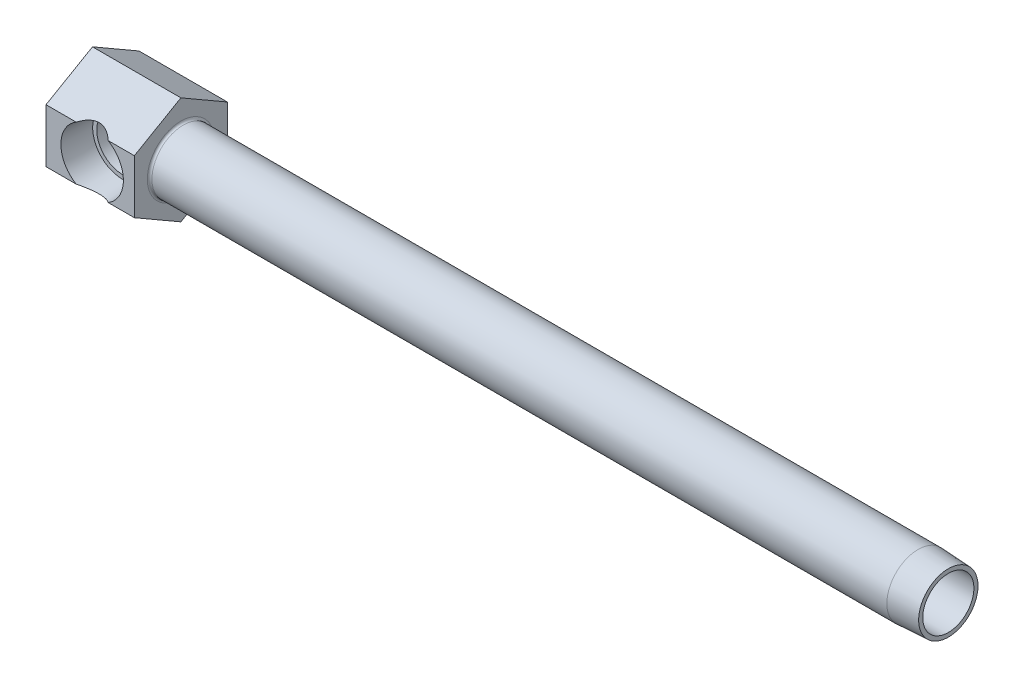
ISO-10303-21;
HEADER;
FILE_DESCRIPTION(('STEP AP214'),'2;1');
FILE_NAME('part.step','',(''),(''),'','','');
FILE_SCHEMA(('AUTOMOTIVE_DESIGN { 1 0 10303 214 1 1 1 1 }'));
ENDSEC;
DATA;
#1=APPLICATION_CONTEXT('core data for automotive mechanical design processes');
#2=APPLICATION_PROTOCOL_DEFINITION('international standard','automotive_design',2000,#1);
#3=PRODUCT_CONTEXT('',#1,'mechanical');
#4=PRODUCT('Part','Part','',(#3));
#5=PRODUCT_RELATED_PRODUCT_CATEGORY('part','',(#4));
#6=PRODUCT_DEFINITION_FORMATION('','',#4);
#7=PRODUCT_DEFINITION_CONTEXT('part definition',#1,'design');
#8=PRODUCT_DEFINITION('design','',#6,#7);
#9=PRODUCT_DEFINITION_SHAPE('','',#8);
#10=(LENGTH_UNIT() NAMED_UNIT(*) SI_UNIT(.MILLI.,.METRE.));
#11=(NAMED_UNIT(*) PLANE_ANGLE_UNIT() SI_UNIT($,.RADIAN.));
#12=(NAMED_UNIT(*) SI_UNIT($,.STERADIAN.) SOLID_ANGLE_UNIT());
#13=UNCERTAINTY_MEASURE_WITH_UNIT(LENGTH_MEASURE(1.E-05),#10,'distance_accuracy_value','');
#14=(GEOMETRIC_REPRESENTATION_CONTEXT(3) GLOBAL_UNCERTAINTY_ASSIGNED_CONTEXT((#13)) GLOBAL_UNIT_ASSIGNED_CONTEXT((#10,
#11,#12)) REPRESENTATION_CONTEXT('',''));
#15=CARTESIAN_POINT('',(0.,0.,0.));
#16=DIRECTION('',(0.,0.,1.));
#17=DIRECTION('',(1.,0.,0.));
#18=AXIS2_PLACEMENT_3D('',#15,#16,#17);
#19=CARTESIAN_POINT('',(63.5,0.,15.875));
#20=DIRECTION('',(-1.,0.,0.));
#21=DIRECTION('',(0.,0.,1.));
#22=AXIS2_PLACEMENT_3D('',#19,#20,#21);
#23=CYLINDRICAL_SURFACE('',#22,10.668);
#24=CARTESIAN_POINT('',(30.9499,0.,15.875));
#25=DIRECTION('',(1.,0.,0.));
#26=DIRECTION('',(0.,1.,0.));
#27=AXIS2_PLACEMENT_3D('',#24,#25,#26);
#28=CIRCLE('',#27,10.668);
#29=CARTESIAN_POINT('',(30.9499,10.668,15.875));
#30=VERTEX_POINT('',#29);
#31=EDGE_CURVE('E191',#30,#30,#28,.T.);
#32=ORIENTED_EDGE('',*,*,#31,.T.);
#33=EDGE_LOOP('',(#32));
#34=FACE_BOUND('',#33,.T.);
#35=CARTESIAN_POINT('',(281.7876,0.,15.875));
#36=DIRECTION('',(1.,0.,0.));
#37=DIRECTION('',(0.,0.,-1.));
#38=AXIS2_PLACEMENT_3D('',#35,#36,#37);
#39=CIRCLE('',#38,10.668);
#40=CARTESIAN_POINT('',(281.7876,0.,5.207));
#41=VERTEX_POINT('',#40);
#42=EDGE_CURVE('E256',#41,#41,#39,.T.);
#43=ORIENTED_EDGE('',*,*,#42,.F.);
#44=EDGE_LOOP('',(#43));
#45=FACE_BOUND('',#44,.T.);
#46=ADVANCED_FACE('F15',(#34,#45),#23,.T.);
#47=CARTESIAN_POINT('',(30.1625,18.3308710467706,15.875));
#48=DIRECTION('',(0.,-0.866025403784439,-0.5));
#49=DIRECTION('',(0.,0.5,-0.866025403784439));
#50=AXIS2_PLACEMENT_3D('',#47,#48,#49);
#51=PLANE('',#50);
#52=CARTESIAN_POINT('',(15.748,-1.05255916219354,49.4480859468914));
#53=DIRECTION('',(0.,-0.866025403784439,-0.5));
#54=DIRECTION('',(0.,-0.5,0.866025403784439));
#55=AXIS2_PLACEMENT_3D('',#52,#53,#54);
#56=ELLIPSE('',#55,23.191034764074,11.5476466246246);
#57=CARTESIAN_POINT('',(21.2070306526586,9.16543552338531,31.75));
#58=VERTEX_POINT('',#57);
#59=CARTESIAN_POINT('',(10.2889693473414,9.16543552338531,31.75));
#60=VERTEX_POINT('',#59);
#61=EDGE_CURVE('E135',#58,#60,#56,.F.);
#62=ORIENTED_EDGE('',*,*,#61,.F.);
#63=DIRECTION('',(-1.,0.,0.));
#64=VECTOR('',#63,1.);
#65=CARTESIAN_POINT('',(30.1625,9.16543552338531,31.75));
#66=LINE('',#65,#64);
#67=CARTESIAN_POINT('',(30.1625,9.16543552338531,31.75));
#68=VERTEX_POINT('',#67);
#69=EDGE_CURVE('E179',#68,#58,#66,.T.);
#70=ORIENTED_EDGE('',*,*,#69,.F.);
#71=DIRECTION('',(0.,-0.5,0.866025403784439));
#72=VECTOR('',#71,1.);
#73=CARTESIAN_POINT('',(30.1625,18.3308710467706,15.875));
#74=LINE('',#73,#72);
#75=CARTESIAN_POINT('',(30.1625,18.3308710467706,15.875));
#76=VERTEX_POINT('',#75);
#77=EDGE_CURVE('E163',#76,#68,#74,.T.);
#78=ORIENTED_EDGE('',*,*,#77,.F.);
#79=DIRECTION('',(-1.,0.,0.));
#80=VECTOR('',#79,1.);
#81=CARTESIAN_POINT('',(30.1625,18.3308710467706,15.875));
#82=LINE('',#81,#80);
#83=CARTESIAN_POINT('',(0.,18.3308710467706,15.875));
#84=VERTEX_POINT('',#83);
#85=EDGE_CURVE('E182',#76,#84,#82,.T.);
#86=ORIENTED_EDGE('',*,*,#85,.T.);
#87=DIRECTION('',(0.,-0.5,0.866025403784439));
#88=VECTOR('',#87,1.);
#89=CARTESIAN_POINT('',(0.,18.3308710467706,15.875));
#90=LINE('',#89,#88);
#91=CARTESIAN_POINT('',(0.,9.16543552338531,31.75));
#92=VERTEX_POINT('',#91);
#93=EDGE_CURVE('E144',#84,#92,#90,.T.);
#94=ORIENTED_EDGE('',*,*,#93,.T.);
#95=EDGE_CURVE('E178',#60,#92,#66,.T.);
#96=ORIENTED_EDGE('',*,*,#95,.F.);
#97=EDGE_LOOP('',(#62,#70,#78,#86,#94,#96));
#98=FACE_BOUND('',#97,.T.);
#99=ADVANCED_FACE('F210',(#98),#51,.F.);
#100=CARTESIAN_POINT('',(30.1625,9.16543552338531,31.75));
#101=DIRECTION('',(0.,0.,-1.));
#102=DIRECTION('',(-1.,0.,0.));
#103=AXIS2_PLACEMENT_3D('',#100,#101,#102);
#104=PLANE('',#103);
#105=CARTESIAN_POINT('',(15.748,0.,31.75));
#106=DIRECTION('',(0.,0.,-1.));
#107=DIRECTION('',(-1.,0.,0.));
#108=AXIS2_PLACEMENT_3D('',#105,#106,#107);
#109=CIRCLE('',#108,10.668);
#110=CARTESIAN_POINT('',(21.2070306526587,-9.1654355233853,31.75));
#111=VERTEX_POINT('',#110);
#112=EDGE_CURVE('E133',#58,#111,#109,.T.);
#113=ORIENTED_EDGE('',*,*,#112,.T.);
#114=DIRECTION('',(-1.,0.,0.));
#115=VECTOR('',#114,1.);
#116=CARTESIAN_POINT('',(30.1625,-9.1654355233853,31.75));
#117=LINE('',#116,#115);
#118=CARTESIAN_POINT('',(30.1625,-9.1654355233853,31.75));
#119=VERTEX_POINT('',#118);
#120=EDGE_CURVE('E175',#119,#111,#117,.T.);
#121=ORIENTED_EDGE('',*,*,#120,.F.);
#122=DIRECTION('',(0.,-1.,0.));
#123=VECTOR('',#122,1.);
#124=CARTESIAN_POINT('',(30.1625,9.16543552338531,31.75));
#125=LINE('',#124,#123);
#126=EDGE_CURVE('E165',#68,#119,#125,.T.);
#127=ORIENTED_EDGE('',*,*,#126,.F.);
#128=ORIENTED_EDGE('',*,*,#69,.T.);
#129=EDGE_LOOP('',(#113,#121,#127,#128));
#130=FACE_BOUND('',#129,.T.);
#131=ADVANCED_FACE('F206',(#130),#104,.F.);
#132=CARTESIAN_POINT('',(10.2889693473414,-9.1654355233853,31.75));
#133=VERTEX_POINT('',#132);
#134=EDGE_CURVE('E40',#133,#60,#109,.T.);
#135=ORIENTED_EDGE('',*,*,#134,.T.);
#136=ORIENTED_EDGE('',*,*,#95,.T.);
#137=DIRECTION('',(0.,-1.,0.));
#138=VECTOR('',#137,1.);
#139=CARTESIAN_POINT('',(0.,9.16543552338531,31.75));
#140=LINE('',#139,#138);
#141=CARTESIAN_POINT('',(0.,-9.1654355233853,31.75));
#142=VERTEX_POINT('',#141);
#143=EDGE_CURVE('E148',#92,#142,#140,.T.);
#144=ORIENTED_EDGE('',*,*,#143,.T.);
#145=EDGE_CURVE('E174',#133,#142,#117,.T.);
#146=ORIENTED_EDGE('',*,*,#145,.F.);
#147=EDGE_LOOP('',(#135,#136,#144,#146));
#148=FACE_BOUND('',#147,.T.);
#149=ADVANCED_FACE('F213',(#148),#104,.F.);
#150=CARTESIAN_POINT('',(30.1625,-9.1654355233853,31.75));
#151=DIRECTION('',(0.,0.866025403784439,-0.5));
#152=DIRECTION('',(0.,0.5,0.866025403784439));
#153=AXIS2_PLACEMENT_3D('',#150,#151,#152);
#154=PLANE('',#153);
#155=CARTESIAN_POINT('',(15.748,1.05255916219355,49.4480859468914));
#156=DIRECTION('',(0.,0.866025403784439,-0.5));
#157=DIRECTION('',(0.,0.5,0.866025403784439));
#158=AXIS2_PLACEMENT_3D('',#155,#156,#157);
#159=ELLIPSE('',#158,23.191034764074,11.5476466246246);
#160=EDGE_CURVE('E26',#133,#111,#159,.F.);
#161=ORIENTED_EDGE('',*,*,#160,.F.);
#162=ORIENTED_EDGE('',*,*,#145,.T.);
#163=DIRECTION('',(0.,-0.5,-0.866025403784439));
#164=VECTOR('',#163,1.);
#165=CARTESIAN_POINT('',(0.,-9.1654355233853,31.75));
#166=LINE('',#165,#164);
#167=CARTESIAN_POINT('',(0.,-18.3308710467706,15.875));
#168=VERTEX_POINT('',#167);
#169=EDGE_CURVE('E152',#142,#168,#166,.T.);
#170=ORIENTED_EDGE('',*,*,#169,.T.);
#171=DIRECTION('',(-1.,0.,0.));
#172=VECTOR('',#171,1.);
#173=CARTESIAN_POINT('',(30.1625,-18.3308710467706,15.875));
#174=LINE('',#173,#172);
#175=CARTESIAN_POINT('',(30.1625,-18.3308710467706,15.875));
#176=VERTEX_POINT('',#175);
#177=EDGE_CURVE('E169',#176,#168,#174,.T.);
#178=ORIENTED_EDGE('',*,*,#177,.F.);
#179=DIRECTION('',(0.,-0.5,-0.866025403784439));
#180=VECTOR('',#179,1.);
#181=CARTESIAN_POINT('',(30.1625,-9.1654355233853,31.75));
#182=LINE('',#181,#180);
#183=EDGE_CURVE('E167',#119,#176,#182,.T.);
#184=ORIENTED_EDGE('',*,*,#183,.F.);
#185=ORIENTED_EDGE('',*,*,#120,.T.);
#186=EDGE_LOOP('',(#161,#162,#170,#178,#184,#185));
#187=FACE_BOUND('',#186,.T.);
#188=ADVANCED_FACE('F202',(#187),#154,.F.);
#189=CARTESIAN_POINT('',(30.1625,-18.3308710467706,15.875));
#190=DIRECTION('',(0.,0.866025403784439,0.5));
#191=DIRECTION('',(0.,-0.5,0.866025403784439));
#192=AXIS2_PLACEMENT_3D('',#189,#190,#191);
#193=PLANE('',#192);
#194=DIRECTION('',(0.,0.5,-0.866025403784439));
#195=VECTOR('',#194,1.);
#196=CARTESIAN_POINT('',(0.,-18.3308710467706,15.875));
#197=LINE('',#196,#195);
#198=CARTESIAN_POINT('',(0.,-9.16543552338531,0.));
#199=VERTEX_POINT('',#198);
#200=EDGE_CURVE('E137',#168,#199,#197,.T.);
#201=ORIENTED_EDGE('',*,*,#200,.T.);
#202=DIRECTION('',(-1.,0.,0.));
#203=VECTOR('',#202,1.);
#204=CARTESIAN_POINT('',(30.1625,-9.16543552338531,0.));
#205=LINE('',#204,#203);
#206=CARTESIAN_POINT('',(30.1625,-9.16543552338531,0.));
#207=VERTEX_POINT('',#206);
#208=EDGE_CURVE('E188',#207,#199,#205,.T.);
#209=ORIENTED_EDGE('',*,*,#208,.F.);
#210=DIRECTION('',(0.,0.5,-0.866025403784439));
#211=VECTOR('',#210,1.);
#212=CARTESIAN_POINT('',(30.1625,-18.3308710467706,15.875));
#213=LINE('',#212,#211);
#214=EDGE_CURVE('E155',#176,#207,#213,.T.);
#215=ORIENTED_EDGE('',*,*,#214,.F.);
#216=ORIENTED_EDGE('',*,*,#177,.T.);
#217=EDGE_LOOP('',(#201,#209,#215,#216));
#218=FACE_BOUND('',#217,.T.);
#219=ADVANCED_FACE('F220',(#218),#193,.F.);
#220=CARTESIAN_POINT('',(30.1625,-9.16543552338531,0.));
#221=DIRECTION('',(0.,0.,1.));
#222=DIRECTION('',(0.,-1.,0.));
#223=AXIS2_PLACEMENT_3D('',#220,#221,#222);
#224=PLANE('',#223);
#225=DIRECTION('',(0.,1.,0.));
#226=VECTOR('',#225,1.);
#227=CARTESIAN_POINT('',(0.,-9.16543552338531,0.));
#228=LINE('',#227,#226);
#229=CARTESIAN_POINT('',(0.,9.16543552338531,0.));
#230=VERTEX_POINT('',#229);
#231=EDGE_CURVE('E138',#199,#230,#228,.T.);
#232=ORIENTED_EDGE('',*,*,#231,.T.);
#233=DIRECTION('',(-1.,0.,0.));
#234=VECTOR('',#233,1.);
#235=CARTESIAN_POINT('',(30.1625,9.16543552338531,0.));
#236=LINE('',#235,#234);
#237=CARTESIAN_POINT('',(30.1625,9.16543552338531,0.));
#238=VERTEX_POINT('',#237);
#239=EDGE_CURVE('E185',#238,#230,#236,.T.);
#240=ORIENTED_EDGE('',*,*,#239,.F.);
#241=DIRECTION('',(0.,1.,0.));
#242=VECTOR('',#241,1.);
#243=CARTESIAN_POINT('',(30.1625,-9.16543552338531,0.));
#244=LINE('',#243,#242);
#245=EDGE_CURVE('E159',#207,#238,#244,.T.);
#246=ORIENTED_EDGE('',*,*,#245,.F.);
#247=ORIENTED_EDGE('',*,*,#208,.T.);
#248=EDGE_LOOP('',(#232,#240,#246,#247));
#249=FACE_BOUND('',#248,.T.);
#250=ADVANCED_FACE('F227',(#249),#224,.F.);
#251=CARTESIAN_POINT('',(30.1625,9.16543552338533,0.));
#252=DIRECTION('',(0.,-0.86602540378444,0.5));
#253=DIRECTION('',(0.,-0.5,-0.86602540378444));
#254=AXIS2_PLACEMENT_3D('',#251,#252,#253);
#255=PLANE('',#254);
#256=DIRECTION('',(0.,0.5,0.86602540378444));
#257=VECTOR('',#256,1.);
#258=CARTESIAN_POINT('',(0.,9.16543552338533,0.));
#259=LINE('',#258,#257);
#260=EDGE_CURVE('E141',#230,#84,#259,.T.);
#261=ORIENTED_EDGE('',*,*,#260,.T.);
#262=ORIENTED_EDGE('',*,*,#85,.F.);
#263=DIRECTION('',(0.,0.5,0.86602540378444));
#264=VECTOR('',#263,1.);
#265=CARTESIAN_POINT('',(30.1625,9.16543552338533,0.));
#266=LINE('',#265,#264);
#267=EDGE_CURVE('E161',#238,#76,#266,.T.);
#268=ORIENTED_EDGE('',*,*,#267,.F.);
#269=ORIENTED_EDGE('',*,*,#239,.T.);
#270=EDGE_LOOP('',(#261,#262,#268,#269));
#271=FACE_BOUND('',#270,.T.);
#272=ADVANCED_FACE('F233',(#271),#255,.F.);
#273=CARTESIAN_POINT('',(30.1625,-9.16543552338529,0.));
#274=DIRECTION('',(1.,0.,0.));
#275=DIRECTION('',(0.,1.,0.));
#276=AXIS2_PLACEMENT_3D('',#273,#274,#275);
#277=PLANE('',#276);
#278=CARTESIAN_POINT('',(30.1625,0.,15.875));
#279=DIRECTION('',(1.,0.,0.));
#280=DIRECTION('',(0.,1.,0.));
#281=AXIS2_PLACEMENT_3D('',#278,#279,#280);
#282=CIRCLE('',#281,11.4554);
#283=CARTESIAN_POINT('',(30.1625,11.4554,15.875));
#284=VERTEX_POINT('',#283);
#285=EDGE_CURVE('E194',#284,#284,#282,.F.);
#286=ORIENTED_EDGE('',*,*,#285,.T.);
#287=EDGE_LOOP('',(#286));
#288=FACE_BOUND('',#287,.T.);
#289=ORIENTED_EDGE('',*,*,#214,.T.);
#290=ORIENTED_EDGE('',*,*,#245,.T.);
#291=ORIENTED_EDGE('',*,*,#267,.T.);
#292=ORIENTED_EDGE('',*,*,#77,.T.);
#293=ORIENTED_EDGE('',*,*,#126,.T.);
#294=ORIENTED_EDGE('',*,*,#183,.T.);
#295=EDGE_LOOP('',(#289,#290,#291,#292,#293,#294));
#296=FACE_BOUND('',#295,.T.);
#297=ADVANCED_FACE('F230',(#288,#296),#277,.T.);
#298=CARTESIAN_POINT('',(0.,-9.16543552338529,0.));
#299=DIRECTION('',(1.,0.,0.));
#300=DIRECTION('',(0.,1.,0.));
#301=AXIS2_PLACEMENT_3D('',#298,#299,#300);
#302=PLANE('',#301);
#303=ORIENTED_EDGE('',*,*,#200,.F.);
#304=ORIENTED_EDGE('',*,*,#169,.F.);
#305=ORIENTED_EDGE('',*,*,#143,.F.);
#306=ORIENTED_EDGE('',*,*,#93,.F.);
#307=ORIENTED_EDGE('',*,*,#260,.F.);
#308=ORIENTED_EDGE('',*,*,#231,.F.);
#309=EDGE_LOOP('',(#303,#304,#305,#306,#307,#308));
#310=FACE_BOUND('',#309,.T.);
#311=ADVANCED_FACE('F222',(#310),#302,.F.);
#312=CARTESIAN_POINT('',(30.9499,0.,15.875));
#313=DIRECTION('',(1.,0.,0.));
#314=DIRECTION('',(0.,1.,0.));
#315=AXIS2_PLACEMENT_3D('',#312,#313,#314);
#316=TOROIDAL_SURFACE('',#315,11.4554,0.7874);
#317=ORIENTED_EDGE('',*,*,#285,.F.);
#318=EDGE_LOOP('',(#317));
#319=FACE_BOUND('',#318,.T.);
#320=ORIENTED_EDGE('',*,*,#31,.F.);
#321=EDGE_LOOP('',(#320));
#322=FACE_BOUND('',#321,.T.);
#323=ADVANCED_FACE('F331',(#319,#322),#316,.F.);
#324=CARTESIAN_POINT('',(15.748,0.,31.75));
#325=DIRECTION('',(0.,0.,1.));
#326=DIRECTION('',(1.,0.,0.));
#327=AXIS2_PLACEMENT_3D('',#324,#325,#326);
#328=CONICAL_SURFACE('',#327,10.668,0.0523598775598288);
#329=CARTESIAN_POINT('',(23.3158678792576,-6.73011387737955,21.4374));
#330=CARTESIAN_POINT('',(23.4600282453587,-6.58213571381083,21.6163914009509));
#331=CARTESIAN_POINT('',(23.6023884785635,-6.42627781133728,21.7904706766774));
#332=CARTESIAN_POINT('',(23.8817354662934,-6.09837401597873,22.1280133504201));
#333=CARTESIAN_POINT('',(24.0187135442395,-5.92630339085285,22.2914598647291));
#334=CARTESIAN_POINT('',(24.2862441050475,-5.56440643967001,22.6077795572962));
#335=CARTESIAN_POINT('',(24.4167288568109,-5.37443622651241,22.7605461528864));
#336=CARTESIAN_POINT('',(24.6677167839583,-4.97815123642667,23.0522714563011));
#337=CARTESIAN_POINT('',(24.7882261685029,-4.77184678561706,23.1912387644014));
#338=CARTESIAN_POINT('',(24.9921660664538,-4.38969848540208,23.4250980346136));
#339=CARTESIAN_POINT('',(25.0779672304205,-4.21696245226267,23.5230096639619));
#340=CARTESIAN_POINT('',(25.2408840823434,-3.86199712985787,23.7082473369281));
#341=CARTESIAN_POINT('',(25.3180018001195,-3.67977007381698,23.7955758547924));
#342=CARTESIAN_POINT('',(25.4621670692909,-3.30686520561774,23.9583559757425));
#343=CARTESIAN_POINT('',(25.529240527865,-3.11621083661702,24.0338381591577));
#344=CARTESIAN_POINT('',(25.6523303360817,-2.72696762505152,24.1720474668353));
#345=CARTESIAN_POINT('',(25.7083523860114,-2.52838293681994,24.2347811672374));
#346=CARTESIAN_POINT('',(25.808749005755,-2.12236093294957,24.3470188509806));
#347=CARTESIAN_POINT('',(25.8530023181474,-1.91485526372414,24.3963851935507));
#348=CARTESIAN_POINT('',(25.9281094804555,-1.49442789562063,24.4800766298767));
#349=CARTESIAN_POINT('',(25.9589631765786,-1.2815061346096,24.5144015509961));
#350=CARTESIAN_POINT('',(26.0065047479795,-0.852126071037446,24.5672608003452));
#351=CARTESIAN_POINT('',(26.023192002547,-0.635667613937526,24.5857944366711));
#352=CARTESIAN_POINT('',(26.0419565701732,-0.201352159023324,24.6066338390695));
#353=CARTESIAN_POINT('',(26.0440358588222,0.0165046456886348,24.6089417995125));
#354=CARTESIAN_POINT('',(26.0342583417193,0.421689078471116,24.5980844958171));
#355=CARTESIAN_POINT('',(26.0242658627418,0.609123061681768,24.5869892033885));
#356=CARTESIAN_POINT('',(25.9935596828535,0.982016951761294,24.552869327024));
#357=CARTESIAN_POINT('',(25.9728460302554,1.16747686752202,24.5298447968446));
#358=CARTESIAN_POINT('',(25.9211099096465,1.53498981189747,24.4722733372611));
#359=CARTESIAN_POINT('',(25.8900948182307,1.71704518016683,24.437734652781));
#360=CARTESIAN_POINT('',(25.8183100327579,2.07675633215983,24.3576745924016));
#361=CARTESIAN_POINT('',(25.7775399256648,2.25441192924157,24.3121527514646));
#362=CARTESIAN_POINT('',(25.6868155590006,2.6047674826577,24.2106610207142));
#363=CARTESIAN_POINT('',(25.6368406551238,2.77745527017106,24.1546676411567));
#364=CARTESIAN_POINT('',(25.5285266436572,3.11671661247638,24.0330221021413));
#365=CARTESIAN_POINT('',(25.4701845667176,3.28328797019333,23.9673665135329));
#366=CARTESIAN_POINT('',(25.2834921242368,3.77365322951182,23.7566792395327));
#367=CARTESIAN_POINT('',(25.1436492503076,4.08744436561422,23.5981203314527));
#368=CARTESIAN_POINT('',(24.8735653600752,4.61896069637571,23.289353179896));
#369=CARTESIAN_POINT('',(24.7480029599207,4.84261456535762,23.1450088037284));
#370=CARTESIAN_POINT('',(24.4850001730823,5.27158893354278,22.8402219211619));
#371=CARTESIAN_POINT('',(24.34754826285,5.47689124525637,22.6797637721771));
#372=CARTESIAN_POINT('',(24.0644488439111,5.86754844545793,22.3458754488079));
#373=CARTESIAN_POINT('',(23.918859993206,6.05302358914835,22.1725357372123));
#374=CARTESIAN_POINT('',(23.6957580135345,6.31733501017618,21.90341371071));
#375=CARTESIAN_POINT('',(23.6206767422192,6.40304815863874,21.8122772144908));
#376=CARTESIAN_POINT('',(23.4691939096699,6.56995442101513,21.6270388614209));
#377=CARTESIAN_POINT('',(23.3927925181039,6.65114811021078,21.5329373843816));
#378=CARTESIAN_POINT('',(23.3158678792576,6.73011387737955,21.4374));
#379=B_SPLINE_CURVE_WITH_KNOTS('',3,(#329,#330,#331,#332,#333,#334,#335,#336,#337,#338,#339,
#340,#341,#342,#343,#344,#345,#346,#347,#348,#349,#350,#351,#352,#353,#354,#355,#356,#357,#358,
#359,#360,#361,#362,#363,#364,#365,#366,#367,#368,#369,#370,#371,#372,#373,#374,#375,#376,#377,
#378),.UNSPECIFIED.,.F.,.F.,(4,2,2,2,2,2,2,2,2,2,2,2,2,2,2,2,2,2,2,2,2,2,2,2,4),(0.,
0.820023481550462,1.64131879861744,2.46989520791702,3.29795193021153,3.94627694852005,
4.59445010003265,5.24092150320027,5.8870585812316,6.53961554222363,7.19217999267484,
7.84477303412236,8.49727781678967,9.06067705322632,9.6240737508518,10.187067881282,
10.7500858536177,11.3143822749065,11.8788794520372,13.0099648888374,13.8917191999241,
14.7743379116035,15.65125682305,16.0888974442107,16.5264822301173),.UNSPECIFIED.);
#380=CARTESIAN_POINT('',(23.3160289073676,-6.72994857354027,21.4376));
#381=VERTEX_POINT('',#380);
#382=CARTESIAN_POINT('',(23.3160289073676,6.72994857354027,21.4376));
#383=VERTEX_POINT('',#382);
#384=EDGE_CURVE('E119',#381,#383,#379,.T.);
#385=ORIENTED_EDGE('',*,*,#384,.F.);
#386=CARTESIAN_POINT('',(15.748,0.,21.4376));
#387=DIRECTION('',(0.,0.,-1.));
#388=DIRECTION('',(-1.,0.,0.));
#389=AXIS2_PLACEMENT_3D('',#386,#387,#388);
#390=CIRCLE('',#389,10.1275500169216);
#391=EDGE_CURVE('E121',#381,#383,#390,.T.);
#392=ORIENTED_EDGE('',*,*,#391,.T.);
#393=EDGE_LOOP('',(#385,#392));
#394=FACE_BOUND('',#393,.T.);
#395=ORIENTED_EDGE('',*,*,#61,.T.);
#396=ORIENTED_EDGE('',*,*,#134,.F.);
#397=ORIENTED_EDGE('',*,*,#160,.T.);
#398=ORIENTED_EDGE('',*,*,#112,.F.);
#399=EDGE_LOOP('',(#395,#396,#397,#398));
#400=FACE_BOUND('',#399,.T.);
#401=ADVANCED_FACE('F196',(#394,#400),#328,.F.);
#402=CARTESIAN_POINT('',(25.8755500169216,0.,21.4376));
#403=DIRECTION('',(0.,0.,1.));
#404=DIRECTION('',(1.,0.,0.));
#405=AXIS2_PLACEMENT_3D('',#402,#403,#404);
#406=PLANE('',#405);
#407=DIRECTION('',(1.,0.,0.));
#408=VECTOR('',#407,1.);
#409=CARTESIAN_POINT('',(86.8155901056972,-6.72994857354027,21.4376));
#410=LINE('',#409,#408);
#411=CARTESIAN_POINT('',(21.3205618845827,-6.72994857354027,21.4376));
#412=VERTEX_POINT('',#411);
#413=EDGE_CURVE('E123',#412,#381,#410,.T.);
#414=ORIENTED_EDGE('',*,*,#413,.F.);
#415=CARTESIAN_POINT('',(15.748,0.,21.4376));
#416=DIRECTION('',(0.,0.,-1.));
#417=DIRECTION('',(-1.,0.,0.));
#418=AXIS2_PLACEMENT_3D('',#415,#416,#417);
#419=CIRCLE('',#418,8.7376);
#420=CARTESIAN_POINT('',(21.3205618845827,6.72994857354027,21.4376));
#421=VERTEX_POINT('',#420);
#422=EDGE_CURVE('E114',#412,#421,#419,.T.);
#423=ORIENTED_EDGE('',*,*,#422,.T.);
#424=DIRECTION('',(1.,0.,0.));
#425=VECTOR('',#424,1.);
#426=CARTESIAN_POINT('',(86.8155901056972,6.72994857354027,21.4376));
#427=LINE('',#426,#425);
#428=EDGE_CURVE('E115',#383,#421,#427,.F.);
#429=ORIENTED_EDGE('',*,*,#428,.F.);
#430=ORIENTED_EDGE('',*,*,#391,.F.);
#431=EDGE_LOOP('',(#414,#423,#429,#430));
#432=FACE_BOUND('',#431,.T.);
#433=ADVANCED_FACE('F316',(#432),#406,.T.);
#434=CARTESIAN_POINT('',(15.748,0.,43.0975954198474));
#435=DIRECTION('',(0.,0.,-1.));
#436=DIRECTION('',(-1.,0.,0.));
#437=AXIS2_PLACEMENT_3D('',#434,#435,#436);
#438=CYLINDRICAL_SURFACE('',#437,8.7376);
#439=CARTESIAN_POINT('',(24.4856,0.,7.14375000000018));
#440=CARTESIAN_POINT('',(24.4855979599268,-0.194584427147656,7.14375204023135));
#441=CARTESIAN_POINT('',(24.4790855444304,-0.389211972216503,7.15026918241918));
#442=CARTESIAN_POINT('',(24.4531687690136,-0.776828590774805,7.17620489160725));
#443=CARTESIAN_POINT('',(24.4337566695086,-0.969816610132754,7.19563120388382));
#444=CARTESIAN_POINT('',(24.3824080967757,-1.35279132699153,7.24701779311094));
#445=CARTESIAN_POINT('',(24.3504484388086,-1.54277178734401,7.27900127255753));
#446=CARTESIAN_POINT('',(24.2746397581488,-1.91800162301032,7.3548673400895));
#447=CARTESIAN_POINT('',(24.230784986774,-2.10324866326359,7.39875568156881));
#448=CARTESIAN_POINT('',(24.1323992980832,-2.46629304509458,7.49721818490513));
#449=CARTESIAN_POINT('',(24.0779544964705,-2.64413729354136,7.55170615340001));
#450=CARTESIAN_POINT('',(23.9590478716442,-2.99304779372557,7.6707093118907));
#451=CARTESIAN_POINT('',(23.8945822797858,-3.16411146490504,7.73522827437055));
#452=CARTESIAN_POINT('',(23.7566100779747,-3.49864884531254,7.87331790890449));
#453=CARTESIAN_POINT('',(23.6831076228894,-3.66212599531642,7.94688442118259));
#454=CARTESIAN_POINT('',(23.5279457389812,-3.98115293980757,8.10218588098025));
#455=CARTESIAN_POINT('',(23.4462844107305,-4.13670087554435,8.18392273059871));
#456=CARTESIAN_POINT('',(23.2407563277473,-4.50158308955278,8.38964777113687));
#457=CARTESIAN_POINT('',(23.1132942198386,-4.7068770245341,8.51723745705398));
#458=CARTESIAN_POINT('',(22.84617651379,-5.10080513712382,8.7846388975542));
#459=CARTESIAN_POINT('',(22.7065197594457,-5.28943773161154,8.92445181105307));
#460=CARTESIAN_POINT('',(22.4166157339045,-5.65057111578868,9.21470277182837));
#461=CARTESIAN_POINT('',(22.2663444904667,-5.82303320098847,9.36516487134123));
#462=CARTESIAN_POINT('',(21.9571971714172,-6.15161912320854,9.67473646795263));
#463=CARTESIAN_POINT('',(21.7983210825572,-6.30774293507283,9.83384597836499));
#464=CARTESIAN_POINT('',(21.410466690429,-6.66146937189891,10.2223222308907));
#465=CARTESIAN_POINT('',(21.1781519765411,-6.85174414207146,10.4550504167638));
#466=CARTESIAN_POINT('',(20.7027527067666,-7.20301910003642,10.9314300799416));
#467=CARTESIAN_POINT('',(20.4596630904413,-7.36400534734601,11.1750866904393));
#468=CARTESIAN_POINT('',(19.9655914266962,-7.65767994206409,11.6705392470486));
#469=CARTESIAN_POINT('',(19.7146188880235,-7.79040098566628,11.922325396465));
#470=CARTESIAN_POINT('',(19.2066974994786,-8.0288054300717,12.432296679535));
#471=CARTESIAN_POINT('',(18.9497514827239,-8.13450137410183,12.6904787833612));
#472=CARTESIAN_POINT('',(18.535849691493,-8.28254836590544,13.1070621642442));
#473=CARTESIAN_POINT('',(18.3802144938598,-8.3332845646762,13.2638590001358));
#474=CARTESIAN_POINT('',(18.0678223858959,-8.42559206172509,13.5791092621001));
#475=CARTESIAN_POINT('',(17.9110652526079,-8.46716148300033,13.7375630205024));
#476=CARTESIAN_POINT('',(17.6309955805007,-8.53322740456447,14.0215802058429));
#477=CARTESIAN_POINT('',(17.5077848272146,-8.5594718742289,14.1468425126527));
#478=CARTESIAN_POINT('',(17.2618022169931,-8.60637337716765,14.3980579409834));
#479=CARTESIAN_POINT('',(17.1390302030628,-8.62704779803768,14.5240076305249));
#480=CARTESIAN_POINT('',(16.9357825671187,-8.65687758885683,14.7346643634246));
#481=CARTESIAN_POINT('',(16.8550481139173,-8.66756378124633,14.8189101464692));
#482=CARTESIAN_POINT('',(16.6937016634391,-8.68665280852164,14.9894220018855));
#483=CARTESIAN_POINT('',(16.6130990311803,-8.6950316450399,15.0756998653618));
#484=CARTESIAN_POINT('',(16.4936864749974,-8.70581636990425,15.2075729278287));
#485=CARTESIAN_POINT('',(16.453897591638,-8.70912835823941,15.2522143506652));
#486=CARTESIAN_POINT('',(16.3753514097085,-8.71513811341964,15.3428639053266));
#487=CARTESIAN_POINT('',(16.336600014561,-8.71783283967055,15.3888775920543));
#488=CARTESIAN_POINT('',(16.2623845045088,-8.72252382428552,15.4819945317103));
#489=CARTESIAN_POINT('',(16.2268715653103,-8.72453249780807,15.5290599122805));
#490=CARTESIAN_POINT('',(16.1615894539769,-8.72786360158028,15.6269900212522));
#491=CARTESIAN_POINT('',(16.1317624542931,-8.72919320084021,15.6778082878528));
#492=CARTESIAN_POINT('',(16.106026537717,-8.73026315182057,15.7432733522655));
#493=CARTESIAN_POINT('',(16.1020065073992,-8.73042652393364,15.7545502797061));
#494=CARTESIAN_POINT('',(16.0948910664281,-8.73071197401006,15.7773932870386));
#495=CARTESIAN_POINT('',(16.0917959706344,-8.73083403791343,15.788959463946));
#496=CARTESIAN_POINT('',(16.0842173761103,-8.7311305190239,15.8238300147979));
#497=CARTESIAN_POINT('',(16.0813461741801,-8.7312389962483,15.8475287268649));
#498=CARTESIAN_POINT('',(16.080808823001,-8.73125946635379,15.8951415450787));
#499=CARTESIAN_POINT('',(16.083177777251,-8.73117013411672,15.9190560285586));
#500=CARTESIAN_POINT('',(16.0925113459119,-8.73080677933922,15.9661053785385));
#501=CARTESIAN_POINT('',(16.099514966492,-8.73053118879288,15.9892318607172));
#502=CARTESIAN_POINT('',(16.1262284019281,-8.72942751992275,16.0598051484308));
#503=CARTESIAN_POINT('',(16.151337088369,-8.7283274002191,16.1050597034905));
#504=CARTESIAN_POINT('',(16.2067600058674,-8.72559491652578,16.1922079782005));
#505=CARTESIAN_POINT('',(16.2371111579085,-8.72395869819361,16.2340745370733));
#506=CARTESIAN_POINT('',(16.3394034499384,-8.71784635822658,16.3674166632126));
#507=CARTESIAN_POINT('',(16.4158450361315,-8.71237926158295,16.4553852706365));
#508=CARTESIAN_POINT('',(16.5713693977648,-8.69907947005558,16.6287851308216));
#509=CARTESIAN_POINT('',(16.6504566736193,-8.69124254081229,16.7142115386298));
#510=CARTESIAN_POINT('',(16.8096315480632,-8.67323190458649,16.8834717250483));
#511=CARTESIAN_POINT('',(16.8897156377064,-8.66306494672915,16.9673093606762));
#512=CARTESIAN_POINT('',(17.0502749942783,-8.64038918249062,17.1341543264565));
#513=CARTESIAN_POINT('',(17.1307499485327,-8.62788201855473,17.2171621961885));
#514=CARTESIAN_POINT('',(17.3707828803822,-8.58710464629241,17.463693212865));
#515=CARTESIAN_POINT('',(17.5305844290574,-8.5553951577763,17.626432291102));
#516=CARTESIAN_POINT('',(17.8496978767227,-8.48264950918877,17.9503078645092));
#517=CARTESIAN_POINT('',(18.0090097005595,-8.44161198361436,18.1114441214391));
#518=CARTESIAN_POINT('',(18.4856528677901,-8.30423407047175,18.592695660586));
#519=CARTESIAN_POINT('',(18.8014587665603,-8.1936672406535,18.9104166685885));
#520=CARTESIAN_POINT('',(19.4255974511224,-7.93318916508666,19.5375986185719));
#521=CARTESIAN_POINT('',(19.7339228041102,-7.78324040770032,19.8470513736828));
#522=CARTESIAN_POINT('',(20.3391141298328,-7.44229907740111,20.4540803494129));
#523=CARTESIAN_POINT('',(20.6359893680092,-7.25134054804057,20.7516661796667));
#524=CARTESIAN_POINT('',(21.1000219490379,-6.910044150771,21.2166598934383));
#525=CARTESIAN_POINT('',(21.2721889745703,-6.7733595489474,21.3891483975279));
#526=CARTESIAN_POINT('',(21.6095045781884,-6.48366113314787,21.7270430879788));
#527=CARTESIAN_POINT('',(21.7746536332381,-6.33064843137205,21.8924497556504));
#528=CARTESIAN_POINT('',(22.2570327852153,-5.84682072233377,22.3755293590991));
#529=CARTESIAN_POINT('',(22.5620480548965,-5.49060305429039,22.6809166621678));
#530=CARTESIAN_POINT('',(23.069916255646,-4.78392446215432,23.1893448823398));
#531=CARTESIAN_POINT('',(23.2811256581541,-4.44561570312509,23.4007639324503));
#532=CARTESIAN_POINT('',(23.5668242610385,-3.90553017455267,23.6867285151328));
#533=CARTESIAN_POINT('',(23.6568667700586,-3.72007663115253,23.7768515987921));
#534=CARTESIAN_POINT('',(23.8252338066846,-3.33876204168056,23.9453649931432));
#535=CARTESIAN_POINT('',(23.9035605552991,-3.14290297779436,24.0237575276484));
#536=CARTESIAN_POINT('',(24.0342740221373,-2.77741093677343,24.1545782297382));
#537=CARTESIAN_POINT('',(24.0887969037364,-2.60930304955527,24.2091448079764));
#538=CARTESIAN_POINT('',(24.1881404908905,-2.26745357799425,24.3085667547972));
#539=CARTESIAN_POINT('',(24.232963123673,-2.0937131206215,24.3534240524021));
#540=CARTESIAN_POINT('',(24.3121701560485,-1.74160557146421,24.4326916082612));
#541=CARTESIAN_POINT('',(24.3465592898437,-1.5632406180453,24.4671066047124));
#542=CARTESIAN_POINT('',(24.4043171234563,-1.20295803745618,24.5249075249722));
#543=CARTESIAN_POINT('',(24.427685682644,-1.02104036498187,24.548293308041));
#544=CARTESIAN_POINT('',(24.463023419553,-0.654283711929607,24.5836569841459));
#545=CARTESIAN_POINT('',(24.4749486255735,-0.46943621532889,24.5955908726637));
#546=CARTESIAN_POINT('',(24.4870048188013,-0.0989697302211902,24.6076558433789));
#547=CARTESIAN_POINT('',(24.4871357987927,0.086649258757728,24.6077869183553));
#548=CARTESIAN_POINT('',(24.4756009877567,0.457153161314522,24.59624371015));
#549=CARTESIAN_POINT('',(24.4639348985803,0.642038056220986,24.5845691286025));
#550=CARTESIAN_POINT('',(24.4290390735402,1.00960102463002,24.5496476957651));
#551=CARTESIAN_POINT('',(24.4058095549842,1.19227913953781,24.5264010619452));
#552=CARTESIAN_POINT('',(24.3499037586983,1.5435978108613,24.4704535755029));
#553=CARTESIAN_POINT('',(24.3178522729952,1.71243875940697,24.4383780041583));
#554=CARTESIAN_POINT('',(24.2443827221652,2.0460500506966,24.3648524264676));
#555=CARTESIAN_POINT('',(24.2029611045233,2.21081882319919,24.3233988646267));
#556=CARTESIAN_POINT('',(24.1113637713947,2.53539687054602,24.231729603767));
#557=CARTESIAN_POINT('',(24.0611880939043,2.69520616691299,24.1815139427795));
#558=CARTESIAN_POINT('',(23.9527394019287,3.0092382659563,24.0729769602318));
#559=CARTESIAN_POINT('',(23.8944647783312,3.16345995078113,24.0146540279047));
#560=CARTESIAN_POINT('',(23.7478576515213,3.52103226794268,23.8679223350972));
#561=CARTESIAN_POINT('',(23.6563189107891,3.72176242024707,23.776303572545));
#562=CARTESIAN_POINT('',(23.4611265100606,4.11105686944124,23.5809334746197));
#563=CARTESIAN_POINT('',(23.3574693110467,4.29961758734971,23.4771785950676));
#564=CARTESIAN_POINT('',(23.1395028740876,4.66439092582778,23.2589969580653));
#565=CARTESIAN_POINT('',(23.0251788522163,4.84058579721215,23.1445553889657));
#566=CARTESIAN_POINT('',(22.7874660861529,5.18020722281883,22.9065848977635));
#567=CARTESIAN_POINT('',(22.6640769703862,5.34363325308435,22.7830556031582));
#568=CARTESIAN_POINT('',(22.3624933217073,5.71583582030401,22.4811084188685));
#569=CARTESIAN_POINT('',(22.1808835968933,5.9190794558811,22.2992637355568));
#570=CARTESIAN_POINT('',(21.8058537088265,6.30238103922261,21.9236994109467));
#571=CARTESIAN_POINT('',(21.6124292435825,6.48243046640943,21.7299754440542));
#572=CARTESIAN_POINT('',(21.2157200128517,6.8203891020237,21.3325794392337));
#573=CARTESIAN_POINT('',(21.0124171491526,6.97825543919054,21.1288891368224));
#574=CARTESIAN_POINT('',(20.5982380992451,7.27223101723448,20.7138083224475));
#575=CARTESIAN_POINT('',(20.3873623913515,7.40834162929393,20.5024182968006));
#576=CARTESIAN_POINT('',(19.884649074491,7.70363293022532,19.9982794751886));
#577=CARTESIAN_POINT('',(19.59030513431,7.85421669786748,19.7029484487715));
#578=CARTESIAN_POINT('',(19.1430322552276,8.05270383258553,19.2536843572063));
#579=CARTESIAN_POINT('',(18.9929116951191,8.11432340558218,19.1028145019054));
#580=CARTESIAN_POINT('',(18.6911065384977,8.2285969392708,18.7992470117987));
#581=CARTESIAN_POINT('',(18.5394220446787,8.28125148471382,18.6465494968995));
#582=CARTESIAN_POINT('',(18.2352261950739,8.37763466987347,18.3399014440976));
#583=CARTESIAN_POINT('',(18.0827174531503,8.42138304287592,18.1859544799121));
#584=CARTESIAN_POINT('',(17.7769311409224,8.5002358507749,17.8765529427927));
#585=CARTESIAN_POINT('',(17.6236534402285,8.53533876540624,17.721098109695));
#586=CARTESIAN_POINT('',(17.3172180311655,8.59695458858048,17.4087584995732));
#587=CARTESIAN_POINT('',(17.164060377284,8.62347694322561,17.2518754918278));
#588=CARTESIAN_POINT('',(16.8589569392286,8.66804695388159,16.935768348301));
#589=CARTESIAN_POINT('',(16.7070105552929,8.68609909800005,16.7765454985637));
#590=CARTESIAN_POINT('',(16.46350407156,8.70877341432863,16.5098735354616));
#591=CARTESIAN_POINT('',(16.3699008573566,8.71589085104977,16.4044258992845));
#592=CARTESIAN_POINT('',(16.2323264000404,8.72430499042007,16.2291085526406));
#593=CARTESIAN_POINT('',(16.1841543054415,8.72679002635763,16.163138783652));
#594=CARTESIAN_POINT('',(16.133496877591,8.729101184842,16.0698810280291));
#595=CARTESIAN_POINT('',(16.1225051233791,8.72957575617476,16.0475182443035));
#596=CARTESIAN_POINT('',(16.1036531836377,8.73036364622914,16.0015173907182));
#597=CARTESIAN_POINT('',(16.0957832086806,8.73067746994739,15.9778835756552));
#598=CARTESIAN_POINT('',(16.0858252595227,8.73106804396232,15.9345234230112));
#599=CARTESIAN_POINT('',(16.0828762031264,8.73118048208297,15.9150042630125));
#600=CARTESIAN_POINT('',(16.0804848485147,8.73127193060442,15.8757632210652));
#601=CARTESIAN_POINT('',(16.0810378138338,8.73125112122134,15.8560416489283));
#602=CARTESIAN_POINT('',(16.085496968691,8.73107971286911,15.8170943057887));
#603=CARTESIAN_POINT('',(16.0893884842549,8.7309296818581,15.7978667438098));
#604=CARTESIAN_POINT('',(16.0998433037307,8.73051484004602,15.7601398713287));
#605=CARTESIAN_POINT('',(16.1064126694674,8.73024976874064,15.7416423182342));
#606=CARTESIAN_POINT('',(16.1364699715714,8.72898749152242,15.6687660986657));
#607=CARTESIAN_POINT('',(16.167275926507,8.72759479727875,15.6175941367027));
#608=CARTESIAN_POINT('',(16.2343481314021,8.72412321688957,15.51885530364));
#609=CARTESIAN_POINT('',(16.2706691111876,8.72203717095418,15.4713327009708));
#610=CARTESIAN_POINT('',(16.3943809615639,8.71408023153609,15.3171540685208));
#611=CARTESIAN_POINT('',(16.4865189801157,8.70682435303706,15.2143256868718));
#612=CARTESIAN_POINT('',(16.6731786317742,8.68900060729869,15.0111482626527));
#613=CARTESIAN_POINT('',(16.7677038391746,8.67842746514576,14.9108034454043));
#614=CARTESIAN_POINT('',(16.9573900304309,8.65402061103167,14.7119565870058));
#615=CARTESIAN_POINT('',(17.0525458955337,8.64020255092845,14.6134480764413));
#616=CARTESIAN_POINT('',(17.2430914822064,8.60927992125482,14.4173129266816));
#617=CARTESIAN_POINT('',(17.3384810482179,8.59217714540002,14.3196858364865));
#618=CARTESIAN_POINT('',(17.7459864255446,8.51203730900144,13.9038911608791));
#619=CARTESIAN_POINT('',(18.0580987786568,8.43292269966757,13.5886112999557));
#620=CARTESIAN_POINT('',(18.6776048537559,8.23825366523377,12.9641986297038));
#621=CARTESIAN_POINT('',(18.9849941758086,8.1226671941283,12.655071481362));
#622=CARTESIAN_POINT('',(19.5923220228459,7.85348929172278,12.0450114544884));
#623=CARTESIAN_POINT('',(19.8922482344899,7.6998391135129,11.744092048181));
#624=CARTESIAN_POINT('',(20.4804833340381,7.35294307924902,11.1542044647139));
#625=CARTESIAN_POINT('',(20.7688011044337,7.15972821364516,10.865227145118));
#626=CARTESIAN_POINT('',(21.2206780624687,6.81483228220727,10.4124550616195));
#627=CARTESIAN_POINT('',(21.3891940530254,6.67617271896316,10.2436383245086));
#628=CARTESIAN_POINT('',(21.7190895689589,6.38282740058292,9.91319894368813));
#629=CARTESIAN_POINT('',(21.8804695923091,6.22814276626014,9.75157579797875));
#630=CARTESIAN_POINT('',(22.3513310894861,5.73984762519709,9.28005235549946));
#631=CARTESIAN_POINT('',(22.6484248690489,5.38133142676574,8.9826055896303));
#632=CARTESIAN_POINT('',(23.141492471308,4.67228730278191,8.48900613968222));
#633=CARTESIAN_POINT('',(23.3459092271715,4.33363653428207,8.2843900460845));
#634=CARTESIAN_POINT('',(23.62145792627,3.79409663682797,8.00858862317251));
#635=CARTESIAN_POINT('',(23.7081391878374,3.60895802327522,7.92183082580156));
#636=CARTESIAN_POINT('',(23.8698120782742,3.2286920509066,7.76001907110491));
#637=CARTESIAN_POINT('',(23.9448062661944,3.03356689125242,7.68496255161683));
#638=CARTESIAN_POINT('',(24.0697191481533,2.66926471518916,7.55994813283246));
#639=CARTESIAN_POINT('',(24.1217294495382,2.50151910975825,7.50789648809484));
#640=CARTESIAN_POINT('',(24.2160793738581,2.16067893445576,7.41347268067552));
#641=CARTESIAN_POINT('',(24.2584209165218,1.98758543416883,7.37109859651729));
#642=CARTESIAN_POINT('',(24.3326749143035,1.63737162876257,7.29678816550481));
#643=CARTESIAN_POINT('',(24.3646094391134,1.46026070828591,7.26482973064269));
#644=CARTESIAN_POINT('',(24.4175977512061,1.10287331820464,7.21180203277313));
#645=CARTESIAN_POINT('',(24.4386569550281,0.922598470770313,7.1907273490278));
#646=CARTESIAN_POINT('',(24.4645620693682,0.61842168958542,7.16480325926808));
#647=CARTESIAN_POINT('',(24.472443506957,0.495022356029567,7.15691607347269));
#648=CARTESIAN_POINT('',(24.48296362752,0.247754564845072,7.14638828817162));
#649=CARTESIAN_POINT('',(24.4856012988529,0.123886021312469,7.14374870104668));
#650=CARTESIAN_POINT('',(24.4856,0.,7.14375000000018));
#651=B_SPLINE_CURVE_WITH_KNOTS('',3,(#439,#440,#441,#442,#443,#444,#445,#446,#447,#448,#449,
#450,#451,#452,#453,#454,#455,#456,#457,#458,#459,#460,#461,#462,#463,#464,#465,#466,#467,#468,
#469,#470,#471,#472,#473,#474,#475,#476,#477,#478,#479,#480,#481,#482,#483,#484,#485,#486,#487,
#488,#489,#490,#491,#492,#493,#494,#495,#496,#497,#498,#499,#500,#501,#502,#503,#504,#505,#506,
#507,#508,#509,#510,#511,#512,#513,#514,#515,#516,#517,#518,#519,#520,#521,#522,#523,#524,#525,
#526,#527,#528,#529,#530,#531,#532,#533,#534,#535,#536,#537,#538,#539,#540,#541,#542,#543,#544,
#545,#546,#547,#548,#549,#550,#551,#552,#553,#554,#555,#556,#557,#558,#559,#560,#561,#562,#563,
#564,#565,#566,#567,#568,#569,#570,#571,#572,#573,#574,#575,#576,#577,#578,#579,#580,#581,#582,
#583,#584,#585,#586,#587,#588,#589,#590,#591,#592,#593,#594,#595,#596,#597,#598,#599,#600,#601,
#602,#603,#604,#605,#606,#607,#608,#609,#610,#611,#612,#613,#614,#615,#616,#617,#618,#619,#620,
#621,#622,#623,#624,#625,#626,#627,#628,#629,#630,#631,#632,#633,#634,#635,#636,#637,#638,#639,
#640,#641,#642,#643,#644,#645,#646,#647,#648,#649,#650),.UNSPECIFIED.,.T.,.F.,(4,2,2,2,2,2,2,2,
2,2,2,2,2,2,2,2,2,2,2,2,2,2,2,2,2,2,2,2,2,2,2,2,2,2,2,2,2,2,2,2,2,2,2,2,2,2,2,2,2,2,2,2,2,2,2,2,
2,2,2,2,2,2,2,2,2,2,2,2,2,2,2,2,2,2,2,2,2,2,2,2,2,2,2,2,2,2,2,2,2,2,2,2,2,2,2,2,2,2,2,2,2,2,2,2,
2,4),(0.,0.583612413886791,1.16757530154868,1.75262232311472,2.3379525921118,2.91870833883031,
3.49968302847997,4.08039159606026,4.66123567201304,5.47979311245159,6.29842824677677,
7.11897529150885,7.93952359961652,9.07759978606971,10.2162162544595,11.3535083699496,
12.4902716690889,13.1701291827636,13.85012577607,14.3830023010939,14.9141955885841,
15.2656970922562,15.62072714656,15.8004033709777,15.9809464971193,16.1580238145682,
16.3331909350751,16.3690696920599,16.4049606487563,16.4760278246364,16.5475725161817,
16.61972713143,16.7737867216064,16.9289791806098,17.2784485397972,17.6285460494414,
17.9776420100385,18.3264938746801,19.0170858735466,19.7077790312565,21.0901665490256,
22.4738756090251,23.8564404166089,24.6940964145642,25.5316953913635,27.2028655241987,
28.5515700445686,29.225841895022,29.8999857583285,30.4543223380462,31.0085486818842,
31.5625231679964,32.1165047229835,32.67260655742,33.2287087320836,33.7848249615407,
34.3409307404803,34.8648402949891,35.3889488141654,35.9130550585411,36.4372655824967,
37.1528654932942,37.8686749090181,38.5854915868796,39.3023376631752,40.2838426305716,
41.265707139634,42.2494438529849,43.2331185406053,44.5610507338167,45.2256261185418,
45.8901581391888,46.5532013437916,47.2163610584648,47.8787882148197,48.5408639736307,
48.964542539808,49.208361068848,49.2829836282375,49.3573702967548,49.4163167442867,
49.4751834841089,49.5337928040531,49.5925355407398,49.7702540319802,49.949867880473,
50.3640564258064,50.7789069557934,51.1917961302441,51.6044604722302,52.9547097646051,
54.3061487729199,55.6596867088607,57.0121684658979,57.8392729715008,58.6663196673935,
60.3161744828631,61.6467920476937,62.3123085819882,62.9776791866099,63.5266629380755,
64.0755375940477,64.6232405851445,65.1706705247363,65.5421672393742,65.9137356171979),.UNSPECIFIED.);
#652=CARTESIAN_POINT('',(23.410585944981,-4.1988606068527,8.21965571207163));
#653=VERTEX_POINT('',#652);
#654=EDGE_CURVE('E104',#653,#412,#651,.T.);
#655=ORIENTED_EDGE('',*,*,#654,.F.);
#656=CARTESIAN_POINT('',(15.748,0.,8.21965571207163));
#657=DIRECTION('',(0.,0.,-1.));
#658=DIRECTION('',(-1.,0.,0.));
#659=AXIS2_PLACEMENT_3D('',#656,#657,#658);
#660=CIRCLE('',#659,8.7376);
#661=CARTESIAN_POINT('',(23.410585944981,4.19886060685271,8.21965571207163));
#662=VERTEX_POINT('',#661);
#663=EDGE_CURVE('E112',#653,#662,#660,.T.);
#664=ORIENTED_EDGE('',*,*,#663,.T.);
#665=EDGE_CURVE('E32',#421,#662,#651,.T.);
#666=ORIENTED_EDGE('',*,*,#665,.F.);
#667=ORIENTED_EDGE('',*,*,#422,.F.);
#668=EDGE_LOOP('',(#655,#664,#666,#667));
#669=FACE_BOUND('',#668,.T.);
#670=ADVANCED_FACE('F111',(#669),#438,.F.);
#671=CARTESIAN_POINT('',(15.748,0.,8.21965571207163));
#672=DIRECTION('',(0.,0.,1.));
#673=DIRECTION('',(1.,0.,0.));
#674=AXIS2_PLACEMENT_3D('',#671,#672,#673);
#675=CONICAL_SURFACE('',#674,8.7376,1.0471975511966);
#676=CARTESIAN_POINT('',(23.4107811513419,4.19922522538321,8.21985571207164));
#677=CARTESIAN_POINT('',(23.367919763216,4.11919395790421,8.17595278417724));
#678=CARTESIAN_POINT('',(23.3270293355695,4.03767589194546,8.13287159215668));
#679=CARTESIAN_POINT('',(23.2492204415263,3.8718198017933,8.04860939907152));
#680=CARTESIAN_POINT('',(23.2123017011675,3.78748197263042,8.00742826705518));
#681=CARTESIAN_POINT('',(23.1076914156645,3.53082485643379,7.8872854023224));
#682=CARTESIAN_POINT('',(23.0459592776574,3.35451271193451,7.81153115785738));
#683=CARTESIAN_POINT('',(22.9381824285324,2.9949771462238,7.67123528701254));
#684=CARTESIAN_POINT('',(22.8919973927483,2.81183308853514,7.60659608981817));
#685=CARTESIAN_POINT('',(22.8127166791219,2.43901153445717,7.48904901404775));
#686=CARTESIAN_POINT('',(22.7796265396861,2.24933131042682,7.43614610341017));
#687=CARTESIAN_POINT('',(22.7225896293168,1.85315874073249,7.34009061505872));
#688=CARTESIAN_POINT('',(22.6993570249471,1.64636373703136,7.29777066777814));
#689=CARTESIAN_POINT('',(22.6626845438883,1.22942523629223,7.2281547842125));
#690=CARTESIAN_POINT('',(22.6492454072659,1.01928148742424,7.20085998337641));
#691=CARTESIAN_POINT('',(22.6302721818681,0.596327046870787,7.16153764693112));
#692=CARTESIAN_POINT('',(22.6247719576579,0.383508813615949,7.14957553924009));
#693=CARTESIAN_POINT('',(22.6209210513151,-0.0424818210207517,7.14125475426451));
#694=CARTESIAN_POINT('',(22.6225699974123,-0.255654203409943,7.14489526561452));
#695=CARTESIAN_POINT('',(22.6333383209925,-0.68327243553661,7.16786503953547));
#696=CARTESIAN_POINT('',(22.6425377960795,-0.897707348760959,7.18736249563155));
#697=CARTESIAN_POINT('',(22.6699228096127,-1.3240495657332,7.24205141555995));
#698=CARTESIAN_POINT('',(22.6881097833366,-1.53595646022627,7.27724538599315));
#699=CARTESIAN_POINT('',(22.7356881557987,-1.95439228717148,7.362629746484));
#700=CARTESIAN_POINT('',(22.765024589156,-2.16094237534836,7.41274631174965));
#701=CARTESIAN_POINT('',(22.8376796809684,-2.56751673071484,7.52712041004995));
#702=CARTESIAN_POINT('',(22.8809887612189,-2.76754536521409,7.59136824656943));
#703=CARTESIAN_POINT('',(22.9613447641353,-3.07251528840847,7.70138682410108));
#704=CARTESIAN_POINT('',(22.9927516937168,-3.18054225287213,7.74283631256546));
#705=CARTESIAN_POINT('',(23.0610067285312,-3.39337844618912,7.82932474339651));
#706=CARTESIAN_POINT('',(23.0978536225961,-3.49818838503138,7.87436288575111));
#707=CARTESIAN_POINT('',(23.1773744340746,-3.70471548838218,7.9678691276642));
#708=CARTESIAN_POINT('',(23.2200768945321,-3.80641431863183,8.01635343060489));
#709=CARTESIAN_POINT('',(23.3111685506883,-4.00587016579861,8.11612059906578));
#710=CARTESIAN_POINT('',(23.3595598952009,-4.10362567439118,8.16740451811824));
#711=CARTESIAN_POINT('',(23.4107811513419,-4.19922522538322,8.21985571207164));
#712=B_SPLINE_CURVE_WITH_KNOTS('',3,(#676,#677,#678,#679,#680,#681,#682,#683,#684,#685,#686,
#687,#688,#689,#690,#691,#692,#693,#694,#695,#696,#697,#698,#699,#700,#701,#702,#703,#704,#705,
#706,#707,#708,#709,#710,#711),.UNSPECIFIED.,.F.,.F.,(4,2,2,2,2,2,2,2,2,2,2,2,2,2,2,2,2,4),(0.,
0.302467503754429,0.604914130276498,1.20849247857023,1.8064670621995,2.40469428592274,
3.04091498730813,3.67718376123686,4.31615869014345,4.9551003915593,5.60090908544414,
6.24682094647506,6.88958900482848,7.53191738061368,7.89140548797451,8.25081367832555,
8.61204058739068,8.97340438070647),.UNSPECIFIED.);
#713=EDGE_CURVE('E10',#662,#653,#712,.T.);
#714=ORIENTED_EDGE('',*,*,#713,.F.);
#715=ORIENTED_EDGE('',*,*,#663,.F.);
#716=EDGE_LOOP('',(#714,#715));
#717=FACE_BOUND('',#716,.T.);
#718=CARTESIAN_POINT('',(15.748,0.,3.17500000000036));
#719=VERTEX_POINT('',#718);
#720=VERTEX_LOOP('',#719);
#721=FACE_BOUND('',#720,.T.);
#722=ADVANCED_FACE('F117',(#717,#721),#675,.F.);
#723=CARTESIAN_POINT('',(86.8155901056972,0.,15.875));
#724=DIRECTION('',(1.,0.,0.));
#725=DIRECTION('',(0.,0.,-1.));
#726=AXIS2_PLACEMENT_3D('',#723,#724,#725);
#727=CYLINDRICAL_SURFACE('',#726,8.73124999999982);
#728=ORIENTED_EDGE('',*,*,#384,.T.);
#729=ORIENTED_EDGE('',*,*,#428,.T.);
#730=ORIENTED_EDGE('',*,*,#665,.T.);
#731=ORIENTED_EDGE('',*,*,#713,.T.);
#732=ORIENTED_EDGE('',*,*,#654,.T.);
#733=ORIENTED_EDGE('',*,*,#413,.T.);
#734=EDGE_LOOP('',(#728,#729,#730,#731,#732,#733));
#735=FACE_BOUND('',#734,.T.);
#736=CARTESIAN_POINT('',(292.1,0.,15.875));
#737=DIRECTION('',(1.,0.,0.));
#738=DIRECTION('',(0.,0.,-1.));
#739=AXIS2_PLACEMENT_3D('',#736,#737,#738);
#740=CIRCLE('',#739,8.73124999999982);
#741=CARTESIAN_POINT('',(292.1,0.,7.14375000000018));
#742=VERTEX_POINT('',#741);
#743=EDGE_CURVE('E261',#742,#742,#740,.T.);
#744=ORIENTED_EDGE('',*,*,#743,.T.);
#745=EDGE_LOOP('',(#744));
#746=FACE_BOUND('',#745,.T.);
#747=ADVANCED_FACE('F102',(#735,#746),#727,.F.);
#748=CARTESIAN_POINT('',(292.1,0.,5.74744998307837));
#749=DIRECTION('',(1.,0.,0.));
#750=DIRECTION('',(0.,0.,-1.));
#751=AXIS2_PLACEMENT_3D('',#748,#749,#750);
#752=PLANE('',#751);
#753=CARTESIAN_POINT('',(292.1,0.,15.875));
#754=DIRECTION('',(1.,0.,0.));
#755=DIRECTION('',(0.,0.,-1.));
#756=AXIS2_PLACEMENT_3D('',#753,#754,#755);
#757=CIRCLE('',#756,10.1275500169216);
#758=CARTESIAN_POINT('',(292.1,0.,5.74744998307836));
#759=VERTEX_POINT('',#758);
#760=EDGE_CURVE('E258',#759,#759,#757,.T.);
#761=ORIENTED_EDGE('',*,*,#760,.T.);
#762=EDGE_LOOP('',(#761));
#763=FACE_BOUND('',#762,.T.);
#764=ORIENTED_EDGE('',*,*,#743,.F.);
#765=EDGE_LOOP('',(#764));
#766=FACE_BOUND('',#765,.T.);
#767=ADVANCED_FACE('F274',(#763,#766),#752,.T.);
#768=CARTESIAN_POINT('',(292.1,0.,15.875));
#769=DIRECTION('',(-1.,0.,0.));
#770=DIRECTION('',(0.,0.,1.));
#771=AXIS2_PLACEMENT_3D('',#768,#769,#770);
#772=CONICAL_SURFACE('',#771,10.1275500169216,0.052359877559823);
#773=ORIENTED_EDGE('',*,*,#42,.T.);
#774=EDGE_LOOP('',(#773));
#775=FACE_BOUND('',#774,.T.);
#776=ORIENTED_EDGE('',*,*,#760,.F.);
#777=EDGE_LOOP('',(#776));
#778=FACE_BOUND('',#777,.T.);
#779=ADVANCED_FACE('F279',(#775,#778),#772,.T.);
#780=CLOSED_SHELL('',(#46,#99,#131,#149,#188,#219,#250,#272,#297,#311,#323,#401,#433,#670,#722,
#747,#767,#779));
#781=MANIFOLD_SOLID_BREP('B1',#780);
#782=ADVANCED_BREP_SHAPE_REPRESENTATION('',(#18,#781),#14);
#783=SHAPE_DEFINITION_REPRESENTATION(#9,#782);
ENDSEC;
END-ISO-10303-21;
